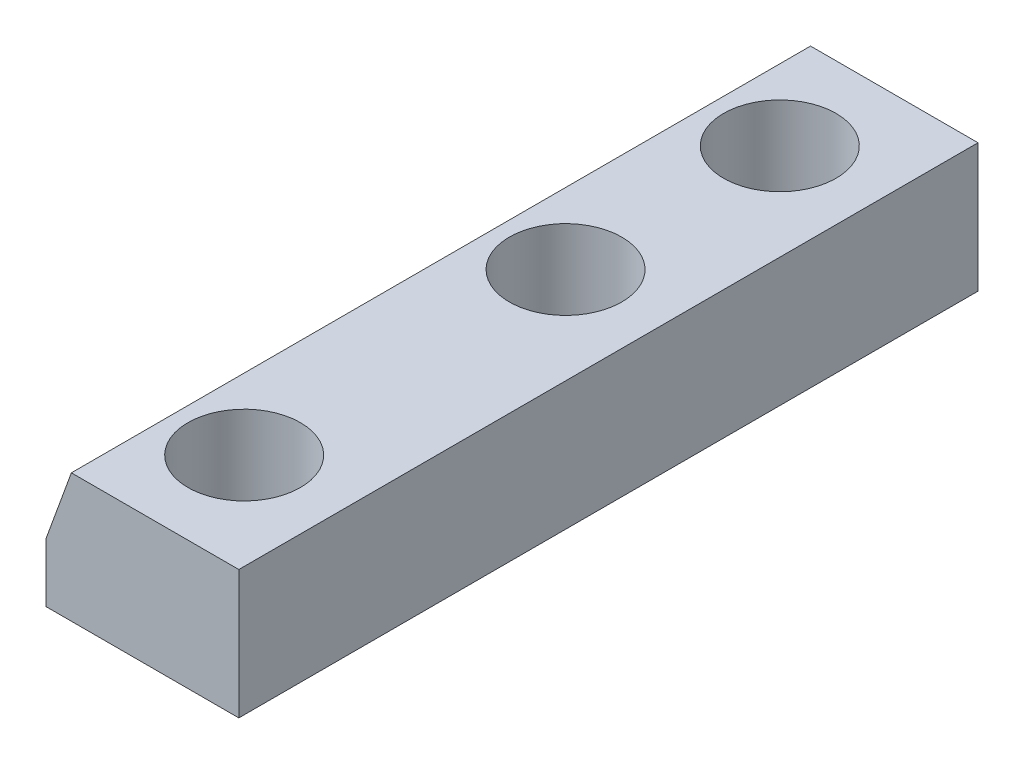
ISO-10303-21;
HEADER;
FILE_DESCRIPTION(('STEP AP214'),'2;1');
FILE_NAME('part.step','',(''),(''),'','','');
FILE_SCHEMA(('AUTOMOTIVE_DESIGN { 1 0 10303 214 1 1 1 1 }'));
ENDSEC;
DATA;
#1=APPLICATION_CONTEXT('core data for automotive mechanical design processes');
#2=APPLICATION_PROTOCOL_DEFINITION('international standard','automotive_design',2000,#1);
#3=PRODUCT_CONTEXT('',#1,'mechanical');
#4=PRODUCT('Part','Part','',(#3));
#5=PRODUCT_RELATED_PRODUCT_CATEGORY('part','',(#4));
#6=PRODUCT_DEFINITION_FORMATION('','',#4);
#7=PRODUCT_DEFINITION_CONTEXT('part definition',#1,'design');
#8=PRODUCT_DEFINITION('design','',#6,#7);
#9=PRODUCT_DEFINITION_SHAPE('','',#8);
#10=(LENGTH_UNIT() NAMED_UNIT(*) SI_UNIT(.MILLI.,.METRE.));
#11=(NAMED_UNIT(*) PLANE_ANGLE_UNIT() SI_UNIT($,.RADIAN.));
#12=(NAMED_UNIT(*) SI_UNIT($,.STERADIAN.) SOLID_ANGLE_UNIT());
#13=UNCERTAINTY_MEASURE_WITH_UNIT(LENGTH_MEASURE(1.E-05),#10,'distance_accuracy_value','');
#14=(GEOMETRIC_REPRESENTATION_CONTEXT(3) GLOBAL_UNCERTAINTY_ASSIGNED_CONTEXT((#13)) GLOBAL_UNIT_ASSIGNED_CONTEXT((#10,
#11,#12)) REPRESENTATION_CONTEXT('',''));
#15=CARTESIAN_POINT('',(0.,0.,0.));
#16=DIRECTION('',(0.,0.,1.));
#17=DIRECTION('',(1.,0.,0.));
#18=AXIS2_PLACEMENT_3D('',#15,#16,#17);
#19=CARTESIAN_POINT('',(1.99999999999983,5.49495483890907,34.5));
#20=DIRECTION('',(-0.939692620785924,0.342020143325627,0.));
#21=DIRECTION('',(-0.342020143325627,-0.939692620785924,0.));
#22=AXIS2_PLACEMENT_3D('',#19,#20,#21);
#23=PLANE('',#22);
#24=DIRECTION('',(0.342020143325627,0.939692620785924,0.));
#25=VECTOR('',#24,1.);
#26=CARTESIAN_POINT('',(1.99999999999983,5.49495483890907,-34.5));
#27=LINE('',#26,#25);
#28=CARTESIAN_POINT('',(1.99999999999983,5.49495483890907,-34.5));
#29=VERTEX_POINT('',#28);
#30=CARTESIAN_POINT('',(4.367642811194,12.,-34.5));
#31=VERTEX_POINT('',#30);
#32=EDGE_CURVE('E110',#29,#31,#27,.T.);
#33=ORIENTED_EDGE('',*,*,#32,.F.);
#34=DIRECTION('',(0.,0.,-1.));
#35=VECTOR('',#34,1.);
#36=CARTESIAN_POINT('',(1.99999999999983,5.49495483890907,34.5));
#37=LINE('',#36,#35);
#38=CARTESIAN_POINT('',(1.99999999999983,5.49495483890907,34.5));
#39=VERTEX_POINT('',#38);
#40=EDGE_CURVE('E11',#39,#29,#37,.T.);
#41=ORIENTED_EDGE('',*,*,#40,.F.);
#42=DIRECTION('',(0.342020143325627,0.939692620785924,0.));
#43=VECTOR('',#42,1.);
#44=CARTESIAN_POINT('',(1.99999999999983,5.49495483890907,34.5));
#45=LINE('',#44,#43);
#46=CARTESIAN_POINT('',(4.367642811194,12.,34.5));
#47=VERTEX_POINT('',#46);
#48=EDGE_CURVE('E105',#39,#47,#45,.T.);
#49=ORIENTED_EDGE('',*,*,#48,.T.);
#50=DIRECTION('',(0.,0.,-1.));
#51=VECTOR('',#50,1.);
#52=CARTESIAN_POINT('',(4.367642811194,12.,34.5));
#53=LINE('',#52,#51);
#54=EDGE_CURVE('E36',#47,#31,#53,.T.);
#55=ORIENTED_EDGE('',*,*,#54,.T.);
#56=EDGE_LOOP('',(#33,#41,#49,#55));
#57=FACE_BOUND('',#56,.T.);
#58=ADVANCED_FACE('F33',(#57),#23,.T.);
#59=CARTESIAN_POINT('',(2.,0.,34.5));
#60=DIRECTION('',(-1.,0.,0.));
#61=DIRECTION('',(0.,-1.,0.));
#62=AXIS2_PLACEMENT_3D('',#59,#60,#61);
#63=PLANE('',#62);
#64=DIRECTION('',(0.,1.,0.));
#65=VECTOR('',#64,1.);
#66=CARTESIAN_POINT('',(2.,0.,-34.5));
#67=LINE('',#66,#65);
#68=CARTESIAN_POINT('',(2.,0.,-34.5));
#69=VERTEX_POINT('',#68);
#70=EDGE_CURVE('E120',#69,#29,#67,.T.);
#71=ORIENTED_EDGE('',*,*,#70,.F.);
#72=DIRECTION('',(0.,0.,-1.));
#73=VECTOR('',#72,1.);
#74=CARTESIAN_POINT('',(2.,0.,34.5));
#75=LINE('',#74,#73);
#76=CARTESIAN_POINT('',(2.,0.,34.5));
#77=VERTEX_POINT('',#76);
#78=EDGE_CURVE('E42',#77,#69,#75,.T.);
#79=ORIENTED_EDGE('',*,*,#78,.F.);
#80=DIRECTION('',(0.,1.,0.));
#81=VECTOR('',#80,1.);
#82=CARTESIAN_POINT('',(2.,0.,34.5));
#83=LINE('',#82,#81);
#84=EDGE_CURVE('E100',#77,#39,#83,.T.);
#85=ORIENTED_EDGE('',*,*,#84,.T.);
#86=ORIENTED_EDGE('',*,*,#40,.T.);
#87=EDGE_LOOP('',(#71,#79,#85,#86));
#88=FACE_BOUND('',#87,.T.);
#89=ADVANCED_FACE('F126',(#88),#63,.T.);
#90=CARTESIAN_POINT('',(20.,0.,34.5));
#91=DIRECTION('',(0.,-1.,0.));
#92=DIRECTION('',(0.,0.,-1.));
#93=AXIS2_PLACEMENT_3D('',#90,#91,#92);
#94=PLANE('',#93);
#95=CARTESIAN_POINT('',(11.,0.,-25.));
#96=DIRECTION('',(0.,-1.,0.));
#97=DIRECTION('',(0.,0.,-1.));
#98=AXIS2_PLACEMENT_3D('',#95,#96,#97);
#99=CIRCLE('',#98,5.24999999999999);
#100=CARTESIAN_POINT('',(11.,0.,-30.25));
#101=VERTEX_POINT('',#100);
#102=EDGE_CURVE('E165',#101,#101,#99,.T.);
#103=ORIENTED_EDGE('',*,*,#102,.F.);
#104=EDGE_LOOP('',(#103));
#105=FACE_BOUND('',#104,.T.);
#106=CARTESIAN_POINT('',(11.,0.,-5.));
#107=DIRECTION('',(0.,-1.,0.));
#108=DIRECTION('',(0.,0.,-1.));
#109=AXIS2_PLACEMENT_3D('',#106,#107,#108);
#110=CIRCLE('',#109,5.24999999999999);
#111=CARTESIAN_POINT('',(11.,0.,-10.25));
#112=VERTEX_POINT('',#111);
#113=EDGE_CURVE('E161',#112,#112,#110,.T.);
#114=ORIENTED_EDGE('',*,*,#113,.F.);
#115=EDGE_LOOP('',(#114));
#116=FACE_BOUND('',#115,.T.);
#117=CARTESIAN_POINT('',(11.,0.,25.));
#118=DIRECTION('',(0.,-1.,0.));
#119=DIRECTION('',(0.,0.,-1.));
#120=AXIS2_PLACEMENT_3D('',#117,#118,#119);
#121=CIRCLE('',#120,5.24999999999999);
#122=CARTESIAN_POINT('',(11.,0.,19.75));
#123=VERTEX_POINT('',#122);
#124=EDGE_CURVE('E155',#123,#123,#121,.T.);
#125=ORIENTED_EDGE('',*,*,#124,.F.);
#126=EDGE_LOOP('',(#125));
#127=FACE_BOUND('',#126,.T.);
#128=DIRECTION('',(-1.,0.,0.));
#129=VECTOR('',#128,1.);
#130=CARTESIAN_POINT('',(20.,0.,-34.5));
#131=LINE('',#130,#129);
#132=CARTESIAN_POINT('',(20.,0.,-34.5));
#133=VERTEX_POINT('',#132);
#134=EDGE_CURVE('E89',#133,#69,#131,.T.);
#135=ORIENTED_EDGE('',*,*,#134,.F.);
#136=DIRECTION('',(0.,0.,-1.));
#137=VECTOR('',#136,1.);
#138=CARTESIAN_POINT('',(20.,0.,34.5));
#139=LINE('',#138,#137);
#140=CARTESIAN_POINT('',(20.,0.,34.5));
#141=VERTEX_POINT('',#140);
#142=EDGE_CURVE('E84',#141,#133,#139,.T.);
#143=ORIENTED_EDGE('',*,*,#142,.F.);
#144=DIRECTION('',(-1.,0.,0.));
#145=VECTOR('',#144,1.);
#146=CARTESIAN_POINT('',(20.,0.,34.5));
#147=LINE('',#146,#145);
#148=EDGE_CURVE('E87',#141,#77,#147,.T.);
#149=ORIENTED_EDGE('',*,*,#148,.T.);
#150=ORIENTED_EDGE('',*,*,#78,.T.);
#151=EDGE_LOOP('',(#135,#143,#149,#150));
#152=FACE_BOUND('',#151,.T.);
#153=ADVANCED_FACE('F86',(#105,#116,#127,#152),#94,.T.);
#154=CARTESIAN_POINT('',(20.,12.,34.5));
#155=DIRECTION('',(1.,0.,0.));
#156=DIRECTION('',(0.,0.,-1.));
#157=AXIS2_PLACEMENT_3D('',#154,#155,#156);
#158=PLANE('',#157);
#159=DIRECTION('',(0.,-1.,0.));
#160=VECTOR('',#159,1.);
#161=CARTESIAN_POINT('',(20.,12.,-34.5));
#162=LINE('',#161,#160);
#163=CARTESIAN_POINT('',(20.,12.,-34.5));
#164=VERTEX_POINT('',#163);
#165=EDGE_CURVE('E117',#164,#133,#162,.T.);
#166=ORIENTED_EDGE('',*,*,#165,.F.);
#167=DIRECTION('',(0.,0.,-1.));
#168=VECTOR('',#167,1.);
#169=CARTESIAN_POINT('',(20.,12.,34.5));
#170=LINE('',#169,#168);
#171=CARTESIAN_POINT('',(20.,12.,34.5));
#172=VERTEX_POINT('',#171);
#173=EDGE_CURVE('E94',#172,#164,#170,.T.);
#174=ORIENTED_EDGE('',*,*,#173,.F.);
#175=DIRECTION('',(0.,-1.,0.));
#176=VECTOR('',#175,1.);
#177=CARTESIAN_POINT('',(20.,12.,34.5));
#178=LINE('',#177,#176);
#179=EDGE_CURVE('E99',#172,#141,#178,.T.);
#180=ORIENTED_EDGE('',*,*,#179,.T.);
#181=ORIENTED_EDGE('',*,*,#142,.T.);
#182=EDGE_LOOP('',(#166,#174,#180,#181));
#183=FACE_BOUND('',#182,.T.);
#184=ADVANCED_FACE('F102',(#183),#158,.T.);
#185=CARTESIAN_POINT('',(4.367642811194,12.,34.5));
#186=DIRECTION('',(0.,1.,0.));
#187=DIRECTION('',(0.,0.,1.));
#188=AXIS2_PLACEMENT_3D('',#185,#186,#187);
#189=PLANE('',#188);
#190=CARTESIAN_POINT('',(11.,12.,-25.));
#191=DIRECTION('',(0.,-1.,0.));
#192=DIRECTION('',(0.,0.,-1.));
#193=AXIS2_PLACEMENT_3D('',#190,#191,#192);
#194=CIRCLE('',#193,5.24999999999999);
#195=CARTESIAN_POINT('',(11.,12.,-30.25));
#196=VERTEX_POINT('',#195);
#197=EDGE_CURVE('E147',#196,#196,#194,.T.);
#198=ORIENTED_EDGE('',*,*,#197,.T.);
#199=EDGE_LOOP('',(#198));
#200=FACE_BOUND('',#199,.T.);
#201=CARTESIAN_POINT('',(11.,12.,-5.));
#202=DIRECTION('',(0.,-1.,0.));
#203=DIRECTION('',(0.,0.,-1.));
#204=AXIS2_PLACEMENT_3D('',#201,#202,#203);
#205=CIRCLE('',#204,5.24999999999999);
#206=CARTESIAN_POINT('',(11.,12.,-10.25));
#207=VERTEX_POINT('',#206);
#208=EDGE_CURVE('E151',#207,#207,#205,.T.);
#209=ORIENTED_EDGE('',*,*,#208,.T.);
#210=EDGE_LOOP('',(#209));
#211=FACE_BOUND('',#210,.T.);
#212=CARTESIAN_POINT('',(11.,12.,25.));
#213=DIRECTION('',(0.,-1.,0.));
#214=DIRECTION('',(0.,0.,-1.));
#215=AXIS2_PLACEMENT_3D('',#212,#213,#214);
#216=CIRCLE('',#215,5.24999999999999);
#217=CARTESIAN_POINT('',(11.,12.,19.75));
#218=VERTEX_POINT('',#217);
#219=EDGE_CURVE('E114',#218,#218,#216,.T.);
#220=ORIENTED_EDGE('',*,*,#219,.T.);
#221=EDGE_LOOP('',(#220));
#222=FACE_BOUND('',#221,.T.);
#223=DIRECTION('',(1.,0.,0.));
#224=VECTOR('',#223,1.);
#225=CARTESIAN_POINT('',(4.367642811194,12.,-34.5));
#226=LINE('',#225,#224);
#227=EDGE_CURVE('E113',#31,#164,#226,.T.);
#228=ORIENTED_EDGE('',*,*,#227,.F.);
#229=ORIENTED_EDGE('',*,*,#54,.F.);
#230=DIRECTION('',(1.,0.,0.));
#231=VECTOR('',#230,1.);
#232=CARTESIAN_POINT('',(4.367642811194,12.,34.5));
#233=LINE('',#232,#231);
#234=EDGE_CURVE('E103',#47,#172,#233,.T.);
#235=ORIENTED_EDGE('',*,*,#234,.T.);
#236=ORIENTED_EDGE('',*,*,#173,.T.);
#237=EDGE_LOOP('',(#228,#229,#235,#236));
#238=FACE_BOUND('',#237,.T.);
#239=ADVANCED_FACE('F123',(#200,#211,#222,#238),#189,.T.);
#240=CARTESIAN_POINT('',(0.,0.,34.5));
#241=DIRECTION('',(0.,0.,-1.));
#242=DIRECTION('',(-1.,0.,0.));
#243=AXIS2_PLACEMENT_3D('',#240,#241,#242);
#244=PLANE('',#243);
#245=ORIENTED_EDGE('',*,*,#48,.F.);
#246=ORIENTED_EDGE('',*,*,#84,.F.);
#247=ORIENTED_EDGE('',*,*,#148,.F.);
#248=ORIENTED_EDGE('',*,*,#179,.F.);
#249=ORIENTED_EDGE('',*,*,#234,.F.);
#250=EDGE_LOOP('',(#245,#246,#247,#248,#249));
#251=FACE_BOUND('',#250,.T.);
#252=ADVANCED_FACE('F98',(#251),#244,.F.);
#253=CARTESIAN_POINT('',(0.,0.,-34.5));
#254=DIRECTION('',(0.,0.,-1.));
#255=DIRECTION('',(-1.,0.,0.));
#256=AXIS2_PLACEMENT_3D('',#253,#254,#255);
#257=PLANE('',#256);
#258=ORIENTED_EDGE('',*,*,#32,.T.);
#259=ORIENTED_EDGE('',*,*,#227,.T.);
#260=ORIENTED_EDGE('',*,*,#165,.T.);
#261=ORIENTED_EDGE('',*,*,#134,.T.);
#262=ORIENTED_EDGE('',*,*,#70,.T.);
#263=EDGE_LOOP('',(#258,#259,#260,#261,#262));
#264=FACE_BOUND('',#263,.T.);
#265=ADVANCED_FACE('F125',(#264),#257,.T.);
#266=CARTESIAN_POINT('',(11.,0.,25.));
#267=DIRECTION('',(0.,-1.,0.));
#268=DIRECTION('',(0.,0.,-1.));
#269=AXIS2_PLACEMENT_3D('',#266,#267,#268);
#270=CYLINDRICAL_SURFACE('',#269,5.24999999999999);
#271=ORIENTED_EDGE('',*,*,#219,.F.);
#272=EDGE_LOOP('',(#271));
#273=FACE_BOUND('',#272,.T.);
#274=ORIENTED_EDGE('',*,*,#124,.T.);
#275=EDGE_LOOP('',(#274));
#276=FACE_BOUND('',#275,.T.);
#277=ADVANCED_FACE('F175',(#273,#276),#270,.F.);
#278=CARTESIAN_POINT('',(11.,0.,-5.));
#279=DIRECTION('',(0.,-1.,0.));
#280=DIRECTION('',(0.,0.,-1.));
#281=AXIS2_PLACEMENT_3D('',#278,#279,#280);
#282=CYLINDRICAL_SURFACE('',#281,5.24999999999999);
#283=ORIENTED_EDGE('',*,*,#208,.F.);
#284=EDGE_LOOP('',(#283));
#285=FACE_BOUND('',#284,.T.);
#286=ORIENTED_EDGE('',*,*,#113,.T.);
#287=EDGE_LOOP('',(#286));
#288=FACE_BOUND('',#287,.T.);
#289=ADVANCED_FACE('F177',(#285,#288),#282,.F.);
#290=CARTESIAN_POINT('',(11.,0.,-25.));
#291=DIRECTION('',(0.,-1.,0.));
#292=DIRECTION('',(0.,0.,-1.));
#293=AXIS2_PLACEMENT_3D('',#290,#291,#292);
#294=CYLINDRICAL_SURFACE('',#293,5.24999999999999);
#295=ORIENTED_EDGE('',*,*,#197,.F.);
#296=EDGE_LOOP('',(#295));
#297=FACE_BOUND('',#296,.T.);
#298=ORIENTED_EDGE('',*,*,#102,.T.);
#299=EDGE_LOOP('',(#298));
#300=FACE_BOUND('',#299,.T.);
#301=ADVANCED_FACE('F169',(#297,#300),#294,.F.);
#302=CLOSED_SHELL('',(#58,#89,#153,#184,#239,#252,#265,#277,#289,#301));
#303=MANIFOLD_SOLID_BREP('B2',#302);
#304=ADVANCED_BREP_SHAPE_REPRESENTATION('',(#18,#303),#14);
#305=SHAPE_DEFINITION_REPRESENTATION(#9,#304);
ENDSEC;
END-ISO-10303-21;
